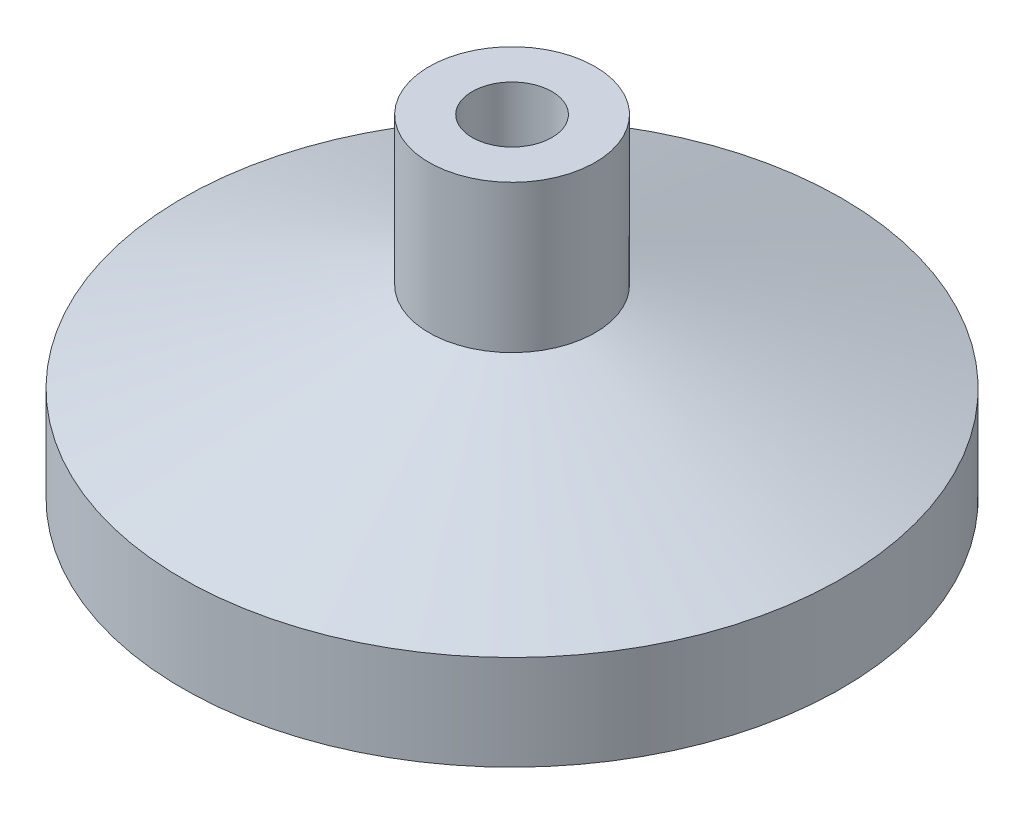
ISO-10303-21;
HEADER;
FILE_DESCRIPTION(('STEP AP214'),'2;1');
FILE_NAME('part.step','',(''),(''),'','','');
FILE_SCHEMA(('AUTOMOTIVE_DESIGN { 1 0 10303 214 1 1 1 1 }'));
ENDSEC;
DATA;
#1=APPLICATION_CONTEXT('core data for automotive mechanical design processes');
#2=APPLICATION_PROTOCOL_DEFINITION('international standard','automotive_design',2000,#1);
#3=PRODUCT_CONTEXT('',#1,'mechanical');
#4=PRODUCT('Part','Part','',(#3));
#5=PRODUCT_RELATED_PRODUCT_CATEGORY('part','',(#4));
#6=PRODUCT_DEFINITION_FORMATION('','',#4);
#7=PRODUCT_DEFINITION_CONTEXT('part definition',#1,'design');
#8=PRODUCT_DEFINITION('design','',#6,#7);
#9=PRODUCT_DEFINITION_SHAPE('','',#8);
#10=(LENGTH_UNIT() NAMED_UNIT(*) SI_UNIT(.MILLI.,.METRE.));
#11=(NAMED_UNIT(*) PLANE_ANGLE_UNIT() SI_UNIT($,.RADIAN.));
#12=(NAMED_UNIT(*) SI_UNIT($,.STERADIAN.) SOLID_ANGLE_UNIT());
#13=UNCERTAINTY_MEASURE_WITH_UNIT(LENGTH_MEASURE(1.E-05),#10,'distance_accuracy_value','');
#14=(GEOMETRIC_REPRESENTATION_CONTEXT(3) GLOBAL_UNCERTAINTY_ASSIGNED_CONTEXT((#13)) GLOBAL_UNIT_ASSIGNED_CONTEXT((#10,
#11,#12)) REPRESENTATION_CONTEXT('',''));
#15=CARTESIAN_POINT('',(0.,0.,0.));
#16=DIRECTION('',(0.,0.,1.));
#17=DIRECTION('',(1.,0.,0.));
#18=AXIS2_PLACEMENT_3D('',#15,#16,#17);
#19=CARTESIAN_POINT('',(0.,0.,0.));
#20=DIRECTION('',(0.,-1.,0.));
#21=DIRECTION('',(0.,0.,-1.00000000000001));
#22=AXIS2_PLACEMENT_3D('',#19,#20,#21);
#23=CYLINDRICAL_SURFACE('',#22,10.922);
#24=CARTESIAN_POINT('',(-6.93889390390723E-13,1.32079999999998,-2.08166817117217E-13));
#25=DIRECTION('',(0.,-1.,0.));
#26=DIRECTION('',(0.,0.,-1.00000000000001));
#27=AXIS2_PLACEMENT_3D('',#24,#25,#26);
#28=CIRCLE('',#27,10.922);
#29=CARTESIAN_POINT('',(-6.7266914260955E-13,1.32079999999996,-10.9220000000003));
#30=VERTEX_POINT('',#29);
#31=EDGE_CURVE('E12',#30,#30,#28,.T.);
#32=ORIENTED_EDGE('',*,*,#31,.F.);
#33=EDGE_LOOP('',(#32));
#34=FACE_BOUND('',#33,.T.);
#35=CARTESIAN_POINT('',(0.,0.,0.));
#36=DIRECTION('',(0.,-1.,0.));
#37=DIRECTION('',(0.,0.,-1.00000000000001));
#38=AXIS2_PLACEMENT_3D('',#35,#36,#37);
#39=CIRCLE('',#38,10.922);
#40=CARTESIAN_POINT('',(0.,0.,-10.9220000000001));
#41=VERTEX_POINT('',#40);
#42=EDGE_CURVE('E73',#41,#41,#39,.T.);
#43=ORIENTED_EDGE('',*,*,#42,.T.);
#44=EDGE_LOOP('',(#43));
#45=FACE_BOUND('',#44,.T.);
#46=ADVANCED_FACE('F39',(#34,#45),#23,.F.);
#47=CARTESIAN_POINT('',(-6.93889390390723E-13,1.32080000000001,-2.08166817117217E-13));
#48=DIRECTION('',(0.,-1.,0.));
#49=DIRECTION('',(0.,0.,-1.00000000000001));
#50=AXIS2_PLACEMENT_3D('',#47,#48,#49);
#51=TOROIDAL_SURFACE('',#50,10.1473,0.7747);
#52=CARTESIAN_POINT('',(-2.22044604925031E-13,1.85299891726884,-1.17961196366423E-13));
#53=DIRECTION('',(0.,-1.,0.));
#54=DIRECTION('',(0.,0.,-1.00000000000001));
#55=AXIS2_PLACEMENT_3D('',#52,#53,#54);
#56=CIRCLE('',#55,9.58433960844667);
#57=CARTESIAN_POINT('',(-2.03423284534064E-13,1.85299891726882,-9.58433960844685));
#58=VERTEX_POINT('',#57);
#59=EDGE_CURVE('E45',#58,#58,#56,.T.);
#60=ORIENTED_EDGE('',*,*,#59,.F.);
#61=EDGE_LOOP('',(#60));
#62=FACE_BOUND('',#61,.T.);
#63=ORIENTED_EDGE('',*,*,#31,.T.);
#64=EDGE_LOOP('',(#63));
#65=FACE_BOUND('',#64,.T.);
#66=ADVANCED_FACE('F122',(#62,#65),#51,.F.);
#67=CARTESIAN_POINT('',(-2.22044604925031E-13,1.85299891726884,-1.17961196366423E-13));
#68=DIRECTION('',(0.,1.,0.));
#69=DIRECTION('',(0.,0.,1.00000000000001));
#70=AXIS2_PLACEMENT_3D('',#67,#68,#69);
#71=CONICAL_SURFACE('',#70,9.58433960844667,0.794623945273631);
#72=CARTESIAN_POINT('',(-8.88178419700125E-13,0.889000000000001,0.));
#73=DIRECTION('',(0.,-1.,0.));
#74=DIRECTION('',(0.,0.,-1.00000000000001));
#75=AXIS2_PLACEMENT_3D('',#72,#73,#74);
#76=CIRCLE('',#75,8.60238725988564);
#77=CARTESIAN_POINT('',(-8.71464924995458E-13,0.888999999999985,-8.60238725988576));
#78=VERTEX_POINT('',#77);
#79=EDGE_CURVE('E49',#78,#78,#76,.T.);
#80=ORIENTED_EDGE('',*,*,#79,.F.);
#81=EDGE_LOOP('',(#80));
#82=FACE_BOUND('',#81,.T.);
#83=ORIENTED_EDGE('',*,*,#59,.T.);
#84=EDGE_LOOP('',(#83));
#85=FACE_BOUND('',#84,.T.);
#86=ADVANCED_FACE('F117',(#82,#85),#71,.T.);
#87=CARTESIAN_POINT('',(-8.60238725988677,0.889000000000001,1.87350135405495E-13));
#88=DIRECTION('',(0.,1.,0.));
#89=DIRECTION('',(0.,0.,1.00000000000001));
#90=AXIS2_PLACEMENT_3D('',#87,#88,#89);
#91=PLANE('',#90);
#92=CARTESIAN_POINT('',(-8.88178419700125E-13,0.889000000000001,0.));
#93=DIRECTION('',(0.,-1.,0.));
#94=DIRECTION('',(0.,0.,-1.00000000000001));
#95=AXIS2_PLACEMENT_3D('',#92,#93,#94);
#96=CIRCLE('',#95,1.524);
#97=CARTESIAN_POINT('',(-8.8521745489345E-13,0.888999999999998,-1.52400000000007));
#98=VERTEX_POINT('',#97);
#99=EDGE_CURVE('E53',#98,#98,#96,.T.);
#100=ORIENTED_EDGE('',*,*,#99,.F.);
#101=EDGE_LOOP('',(#100));
#102=FACE_BOUND('',#101,.T.);
#103=ORIENTED_EDGE('',*,*,#79,.T.);
#104=EDGE_LOOP('',(#103));
#105=FACE_BOUND('',#104,.T.);
#106=ADVANCED_FACE('F111',(#102,#105),#91,.F.);
#107=CARTESIAN_POINT('',(0.,0.,0.));
#108=DIRECTION('',(0.,-1.,0.));
#109=DIRECTION('',(0.,0.,-1.00000000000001));
#110=AXIS2_PLACEMENT_3D('',#107,#108,#109);
#111=CYLINDRICAL_SURFACE('',#110,1.524);
#112=CARTESIAN_POINT('',(-3.88578058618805E-13,12.7,-1.45716771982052E-13));
#113=DIRECTION('',(0.,-1.,0.));
#114=DIRECTION('',(0.,0.,-1.00000000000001));
#115=AXIS2_PLACEMENT_3D('',#112,#113,#114);
#116=CIRCLE('',#115,1.524);
#117=CARTESIAN_POINT('',(-3.85617093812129E-13,12.7,-1.52400000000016));
#118=VERTEX_POINT('',#117);
#119=EDGE_CURVE('E58',#118,#118,#116,.T.);
#120=ORIENTED_EDGE('',*,*,#119,.F.);
#121=EDGE_LOOP('',(#120));
#122=FACE_BOUND('',#121,.T.);
#123=ORIENTED_EDGE('',*,*,#99,.T.);
#124=EDGE_LOOP('',(#123));
#125=FACE_BOUND('',#124,.T.);
#126=ADVANCED_FACE('F105',(#122,#125),#111,.F.);
#127=CARTESIAN_POINT('',(-1.52400000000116,12.7,-5.34294830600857E-13));
#128=DIRECTION('',(0.,-1.,0.));
#129=DIRECTION('',(0.,0.,-1.00000000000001));
#130=AXIS2_PLACEMENT_3D('',#127,#128,#129);
#131=PLANE('',#130);
#132=CARTESIAN_POINT('',(-3.88578058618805E-13,12.7,-1.45716771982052E-13));
#133=DIRECTION('',(0.,-1.,0.));
#134=DIRECTION('',(0.,0.,-1.00000000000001));
#135=AXIS2_PLACEMENT_3D('',#132,#133,#134);
#136=CIRCLE('',#135,3.175);
#137=CARTESIAN_POINT('',(-3.82409381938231E-13,12.7,-3.17500000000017));
#138=VERTEX_POINT('',#137);
#139=EDGE_CURVE('E61',#138,#138,#136,.T.);
#140=ORIENTED_EDGE('',*,*,#139,.F.);
#141=EDGE_LOOP('',(#140));
#142=FACE_BOUND('',#141,.T.);
#143=ORIENTED_EDGE('',*,*,#119,.T.);
#144=EDGE_LOOP('',(#143));
#145=FACE_BOUND('',#144,.T.);
#146=ADVANCED_FACE('F99',(#142,#145),#131,.F.);
#147=CARTESIAN_POINT('',(0.,0.,0.));
#148=DIRECTION('',(0.,-1.,0.));
#149=DIRECTION('',(0.,0.,-1.00000000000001));
#150=AXIS2_PLACEMENT_3D('',#147,#148,#149);
#151=CYLINDRICAL_SURFACE('',#150,3.175);
#152=CARTESIAN_POINT('',(0.,7.06203710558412,0.));
#153=DIRECTION('',(0.,-1.,0.));
#154=DIRECTION('',(0.,0.,-1.00000000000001));
#155=AXIS2_PLACEMENT_3D('',#152,#153,#154);
#156=CIRCLE('',#155,3.175);
#157=CARTESIAN_POINT('',(0.,7.06203710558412,-3.175));
#158=VERTEX_POINT('',#157);
#159=EDGE_CURVE('E64',#158,#158,#156,.T.);
#160=ORIENTED_EDGE('',*,*,#159,.F.);
#161=EDGE_LOOP('',(#160));
#162=FACE_BOUND('',#161,.T.);
#163=ORIENTED_EDGE('',*,*,#139,.T.);
#164=EDGE_LOOP('',(#163));
#165=FACE_BOUND('',#164,.T.);
#166=ADVANCED_FACE('F93',(#162,#165),#151,.T.);
#167=CARTESIAN_POINT('',(0.,7.06203710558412,0.));
#168=DIRECTION('',(0.,-1.,0.));
#169=DIRECTION('',(0.,0.,-1.00000000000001));
#170=AXIS2_PLACEMENT_3D('',#167,#168,#169);
#171=CONICAL_SURFACE('',#170,3.175,1.22173047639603);
#172=CARTESIAN_POINT('',(0.,3.6322,0.));
#173=DIRECTION('',(0.,-1.,0.));
#174=DIRECTION('',(0.,0.,-1.00000000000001));
#175=AXIS2_PLACEMENT_3D('',#172,#173,#174);
#176=CIRCLE('',#175,12.5984);
#177=CARTESIAN_POINT('',(0.,3.63220000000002,-12.5984));
#178=VERTEX_POINT('',#177);
#179=EDGE_CURVE('E67',#178,#178,#176,.T.);
#180=CARTESIAN_POINT('',(0.,3.63220000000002,-12.5984));
#181=CARTESIAN_POINT('',(0.,3.66792746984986,-12.5002395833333));
#182=CARTESIAN_POINT('',(0.,3.70365493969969,-12.4020791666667));
#183=CARTESIAN_POINT('',(0.,3.77510987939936,-12.2057583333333));
#184=CARTESIAN_POINT('',(0.,3.8108373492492,-12.1075979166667));
#185=CARTESIAN_POINT('',(0.,3.88229228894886,-11.9112770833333));
#186=CARTESIAN_POINT('',(0.,3.9180197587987,-11.8131166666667));
#187=CARTESIAN_POINT('',(0.,3.98947469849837,-11.6167958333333));
#188=CARTESIAN_POINT('',(0.,4.0252021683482,-11.5186354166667));
#189=CARTESIAN_POINT('',(0.,4.09665710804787,-11.3223145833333));
#190=CARTESIAN_POINT('',(0.,4.13238457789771,-11.2241541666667));
#191=CARTESIAN_POINT('',(0.,4.20383951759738,-11.0278333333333));
#192=CARTESIAN_POINT('',(0.,4.23956698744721,-10.9296729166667));
#193=CARTESIAN_POINT('',(0.,4.31102192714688,-10.7333520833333));
#194=CARTESIAN_POINT('',(0.,4.34674939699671,-10.6351916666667));
#195=CARTESIAN_POINT('',(0.,4.41820433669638,-10.4388708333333));
#196=CARTESIAN_POINT('',(0.,4.45393180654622,-10.3407104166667));
#197=CARTESIAN_POINT('',(0.,4.52538674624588,-10.1443895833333));
#198=CARTESIAN_POINT('',(0.,4.56111421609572,-10.0462291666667));
#199=CARTESIAN_POINT('',(0.,4.63256915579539,-9.84990833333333));
#200=CARTESIAN_POINT('',(0.,4.66829662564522,-9.75174791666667));
#201=CARTESIAN_POINT('',(0.,4.73975156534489,-9.55542708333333));
#202=CARTESIAN_POINT('',(0.,4.77547903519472,-9.45726666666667));
#203=CARTESIAN_POINT('',(0.,4.84693397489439,-9.26094583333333));
#204=CARTESIAN_POINT('',(0.,4.88266144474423,-9.16278541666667));
#205=CARTESIAN_POINT('',(0.,4.9541163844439,-8.96646458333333));
#206=CARTESIAN_POINT('',(0.,4.98984385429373,-8.86830416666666));
#207=CARTESIAN_POINT('',(0.,5.0612987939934,-8.67198333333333));
#208=CARTESIAN_POINT('',(0.,5.09702626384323,-8.57382291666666));
#209=CARTESIAN_POINT('',(0.,5.1684812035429,-8.37750208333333));
#210=CARTESIAN_POINT('',(0.,5.20420867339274,-8.27934166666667));
#211=CARTESIAN_POINT('',(0.,5.27566361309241,-8.08302083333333));
#212=CARTESIAN_POINT('',(0.,5.31139108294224,-7.98486041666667));
#213=CARTESIAN_POINT('',(0.,5.38284602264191,-7.78853958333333));
#214=CARTESIAN_POINT('',(0.,5.41857349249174,-7.69037916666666));
#215=CARTESIAN_POINT('',(0.,5.49002843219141,-7.49405833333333));
#216=CARTESIAN_POINT('',(0.,5.52575590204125,-7.39589791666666));
#217=CARTESIAN_POINT('',(0.,5.59721084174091,-7.19957708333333));
#218=CARTESIAN_POINT('',(0.,5.63293831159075,-7.10141666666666));
#219=CARTESIAN_POINT('',(0.,5.70439325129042,-6.90509583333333));
#220=CARTESIAN_POINT('',(0.,5.74012072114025,-6.80693541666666));
#221=CARTESIAN_POINT('',(0.,5.81157566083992,-6.61061458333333));
#222=CARTESIAN_POINT('',(0.,5.84730313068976,-6.51245416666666));
#223=CARTESIAN_POINT('',(0.,5.91875807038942,-6.31613333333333));
#224=CARTESIAN_POINT('',(0.,5.95448554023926,-6.21797291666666));
#225=CARTESIAN_POINT('',(0.,6.02594047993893,-6.02165208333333));
#226=CARTESIAN_POINT('',(0.,6.06166794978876,-5.92349166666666));
#227=CARTESIAN_POINT('',(0.,6.13312288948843,-5.72717083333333));
#228=CARTESIAN_POINT('',(0.,6.16885035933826,-5.62901041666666));
#229=CARTESIAN_POINT('',(0.,6.24030529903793,-5.43268958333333));
#230=CARTESIAN_POINT('',(0.,6.27603276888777,-5.33452916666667));
#231=CARTESIAN_POINT('',(0.,6.34748770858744,-5.13820833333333));
#232=CARTESIAN_POINT('',(0.,6.38321517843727,-5.04004791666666));
#233=CARTESIAN_POINT('',(0.,6.45467011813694,-4.84372708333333));
#234=CARTESIAN_POINT('',(0.,6.49039758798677,-4.74556666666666));
#235=CARTESIAN_POINT('',(0.,6.56185252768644,-4.54924583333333));
#236=CARTESIAN_POINT('',(0.,6.59757999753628,-4.45108541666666));
#237=CARTESIAN_POINT('',(0.,6.66903493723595,-4.25476458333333));
#238=CARTESIAN_POINT('',(0.,6.70476240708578,-4.15660416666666));
#239=CARTESIAN_POINT('',(0.,6.77621734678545,-3.96028333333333));
#240=CARTESIAN_POINT('',(0.,6.81194481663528,-3.86212291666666));
#241=CARTESIAN_POINT('',(0.,6.88339975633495,-3.66580208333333));
#242=CARTESIAN_POINT('',(0.,6.91912722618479,-3.56764166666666));
#243=CARTESIAN_POINT('',(0.,6.99058216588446,-3.37132083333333));
#244=CARTESIAN_POINT('',(0.,7.02630963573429,-3.27316041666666));
#245=CARTESIAN_POINT('',(0.,7.06203710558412,-3.175));
#246=B_SPLINE_CURVE_WITH_KNOTS('',3,(#180,#181,#182,#183,#184,#185,#186,#187,#188,#189,#190,
#191,#192,#193,#194,#195,#196,#197,#198,#199,#200,#201,#202,#203,#204,#205,#206,#207,#208,#209,
#210,#211,#212,#213,#214,#215,#216,#217,#218,#219,#220,#221,#222,#223,#224,#225,#226,#227,#228,
#229,#230,#231,#232,#233,#234,#235,#236,#237,#238,#239,#240,#241,#242,#243,#244,#245),
.UNSPECIFIED.,.F.,.F.,(4,2,2,2,2,2,2,2,2,2,2,2,2,2,2,2,2,2,2,2,2,2,2,2,2,2,2,2,2,2,2,2,4),(0.,
0.313380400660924,0.626760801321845,0.940141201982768,1.25352160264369,1.56690200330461,
1.88028240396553,2.19366280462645,2.50704320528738,2.8204236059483,3.13380400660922,
3.44718440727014,3.76056480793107,4.07394520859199,4.38732560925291,4.70070600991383,
5.01408641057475,5.32746681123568,5.6408472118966,5.95422761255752,6.26760801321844,
6.58098841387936,6.89436881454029,7.20774921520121,7.52112961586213,7.83451001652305,
8.14789041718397,8.4612708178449,8.77465121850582,9.08803161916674,9.40141201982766,
9.71479242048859,10.0281728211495),.UNSPECIFIED.);
#247=EDGE_CURVE('BSEAM87',#178,#158,#246,.T.);
#248=ORIENTED_EDGE('',*,*,#179,.F.);
#249=ORIENTED_EDGE('',*,*,#159,.T.);
#250=ORIENTED_EDGE('',*,*,#247,.T.);
#251=ORIENTED_EDGE('',*,*,#247,.F.);
#252=EDGE_LOOP('',(#248,#250,#249,#251));
#253=FACE_BOUND('',#252,.T.);
#254=ADVANCED_FACE('F87',(#253),#171,.T.);
#255=CARTESIAN_POINT('',(0.,0.,0.));
#256=DIRECTION('',(0.,-1.,0.));
#257=DIRECTION('',(0.,0.,-1.00000000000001));
#258=AXIS2_PLACEMENT_3D('',#255,#256,#257);
#259=CYLINDRICAL_SURFACE('',#258,12.5984);
#260=CARTESIAN_POINT('',(0.,0.,0.));
#261=DIRECTION('',(0.,-1.,0.));
#262=DIRECTION('',(0.,0.,-1.00000000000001));
#263=AXIS2_PLACEMENT_3D('',#260,#261,#262);
#264=CIRCLE('',#263,12.5984);
#265=CARTESIAN_POINT('',(0.,0.,-12.5984000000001));
#266=VERTEX_POINT('',#265);
#267=EDGE_CURVE('E70',#266,#266,#264,.T.);
#268=ORIENTED_EDGE('',*,*,#267,.F.);
#269=EDGE_LOOP('',(#268));
#270=FACE_BOUND('',#269,.T.);
#271=ORIENTED_EDGE('',*,*,#179,.T.);
#272=EDGE_LOOP('',(#271));
#273=FACE_BOUND('',#272,.T.);
#274=ADVANCED_FACE('F81',(#270,#273),#259,.T.);
#275=CARTESIAN_POINT('',(-12.5984,0.,-1.31838984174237E-13));
#276=DIRECTION('',(0.,1.,0.));
#277=DIRECTION('',(0.,0.,1.00000000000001));
#278=AXIS2_PLACEMENT_3D('',#275,#276,#277);
#279=PLANE('',#278);
#280=ORIENTED_EDGE('',*,*,#42,.F.);
#281=EDGE_LOOP('',(#280));
#282=FACE_BOUND('',#281,.T.);
#283=ORIENTED_EDGE('',*,*,#267,.T.);
#284=EDGE_LOOP('',(#283));
#285=FACE_BOUND('',#284,.T.);
#286=ADVANCED_FACE('F78',(#282,#285),#279,.F.);
#287=CLOSED_SHELL('',(#46,#66,#86,#106,#126,#146,#166,#254,#274,#286));
#288=MANIFOLD_SOLID_BREP('B2',#287);
#289=ADVANCED_BREP_SHAPE_REPRESENTATION('',(#18,#288),#14);
#290=SHAPE_DEFINITION_REPRESENTATION(#9,#289);
ENDSEC;
END-ISO-10303-21;
